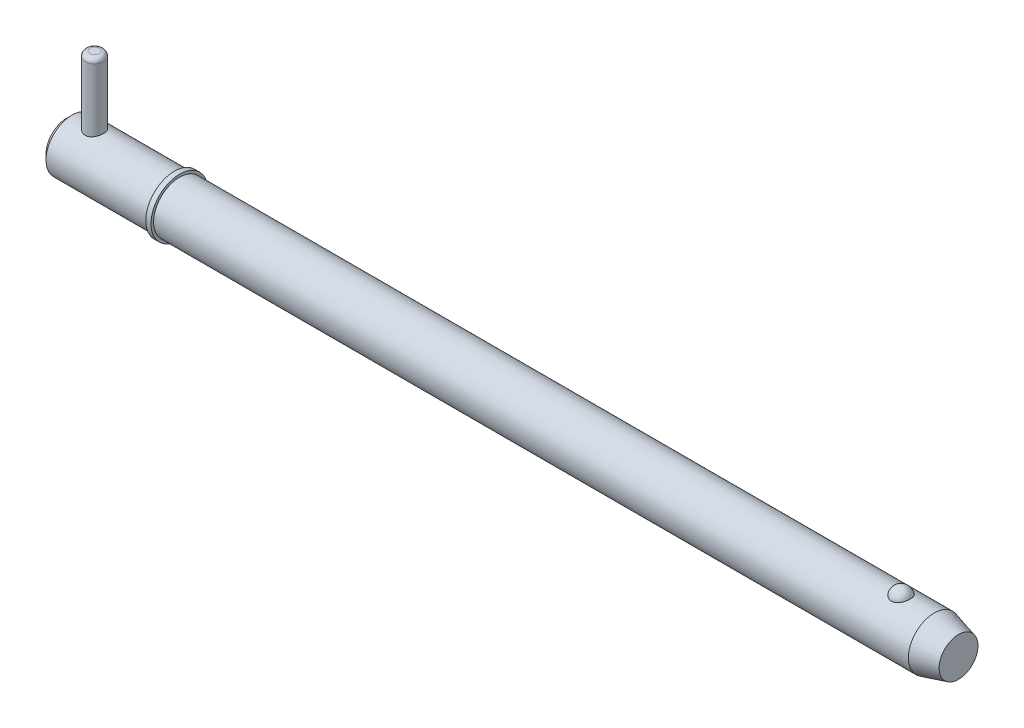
ISO-10303-21;
HEADER;
FILE_DESCRIPTION(('STEP AP214'),'2;1');
FILE_NAME('part.step','',(''),(''),'','','');
FILE_SCHEMA(('AUTOMOTIVE_DESIGN { 1 0 10303 214 1 1 1 1 }'));
ENDSEC;
DATA;
#1=APPLICATION_CONTEXT('core data for automotive mechanical design processes');
#2=APPLICATION_PROTOCOL_DEFINITION('international standard','automotive_design',2000,#1);
#3=PRODUCT_CONTEXT('',#1,'mechanical');
#4=PRODUCT('Part','Part','',(#3));
#5=PRODUCT_RELATED_PRODUCT_CATEGORY('part','',(#4));
#6=PRODUCT_DEFINITION_FORMATION('','',#4);
#7=PRODUCT_DEFINITION_CONTEXT('part definition',#1,'design');
#8=PRODUCT_DEFINITION('design','',#6,#7);
#9=PRODUCT_DEFINITION_SHAPE('','',#8);
#10=(LENGTH_UNIT() NAMED_UNIT(*) SI_UNIT(.MILLI.,.METRE.));
#11=(NAMED_UNIT(*) PLANE_ANGLE_UNIT() SI_UNIT($,.RADIAN.));
#12=(NAMED_UNIT(*) SI_UNIT($,.STERADIAN.) SOLID_ANGLE_UNIT());
#13=UNCERTAINTY_MEASURE_WITH_UNIT(LENGTH_MEASURE(1.E-05),#10,'distance_accuracy_value','');
#14=(GEOMETRIC_REPRESENTATION_CONTEXT(3) GLOBAL_UNCERTAINTY_ASSIGNED_CONTEXT((#13)) GLOBAL_UNIT_ASSIGNED_CONTEXT((#10,
#11,#12)) REPRESENTATION_CONTEXT('',''));
#15=CARTESIAN_POINT('',(0.,0.,0.));
#16=DIRECTION('',(0.,0.,1.));
#17=DIRECTION('',(1.,0.,0.));
#18=AXIS2_PLACEMENT_3D('',#15,#16,#17);
#19=CARTESIAN_POINT('',(5.94,19.845,0.));
#20=DIRECTION('',(0.,-1.,0.));
#21=DIRECTION('',(0.,0.,-1.));
#22=AXIS2_PLACEMENT_3D('',#19,#20,#21);
#23=CYLINDRICAL_SURFACE('',#22,1.98);
#24=CARTESIAN_POINT('',(5.94,-4.565,0.));
#25=DIRECTION('',(0.,1.,0.));
#26=DIRECTION('',(0.,0.,1.));
#27=AXIS2_PLACEMENT_3D('',#24,#25,#26);
#28=CIRCLE('',#27,1.98);
#29=CARTESIAN_POINT('',(5.94,-4.565,1.98));
#30=VERTEX_POINT('',#29);
#31=EDGE_CURVE('P0_E25',#30,#30,#28,.T.);
#32=ORIENTED_EDGE('',*,*,#31,.T.);
#33=EDGE_LOOP('',(#32));
#34=FACE_BOUND('',#33,.T.);
#35=CARTESIAN_POINT('',(5.94,18.855,0.));
#36=DIRECTION('',(0.,1.,0.));
#37=DIRECTION('',(0.,0.,1.));
#38=AXIS2_PLACEMENT_3D('',#35,#36,#37);
#39=CIRCLE('',#38,1.98);
#40=CARTESIAN_POINT('',(5.94,18.855,1.98));
#41=VERTEX_POINT('',#40);
#42=EDGE_CURVE('P0_E29',#41,#41,#39,.F.);
#43=ORIENTED_EDGE('',*,*,#42,.T.);
#44=EDGE_LOOP('',(#43));
#45=FACE_BOUND('',#44,.T.);
#46=ADVANCED_FACE('P0_F14',(#34,#45),#23,.T.);
#47=CARTESIAN_POINT('',(5.94,19.845,0.));
#48=DIRECTION('',(0.,1.,0.));
#49=DIRECTION('',(0.,0.,1.));
#50=AXIS2_PLACEMENT_3D('',#47,#48,#49);
#51=PLANE('',#50);
#52=CARTESIAN_POINT('',(5.94,19.845,0.));
#53=DIRECTION('',(0.,1.,0.));
#54=DIRECTION('',(0.,0.,1.));
#55=AXIS2_PLACEMENT_3D('',#52,#53,#54);
#56=CIRCLE('',#55,0.99);
#57=CARTESIAN_POINT('',(5.94,19.845,0.99));
#58=VERTEX_POINT('',#57);
#59=EDGE_CURVE('P0_E10',#58,#58,#56,.T.);
#60=ORIENTED_EDGE('',*,*,#59,.T.);
#61=EDGE_LOOP('',(#60));
#62=FACE_BOUND('',#61,.T.);
#63=ADVANCED_FACE('P0_F46',(#62),#51,.T.);
#64=CARTESIAN_POINT('',(5.94,-5.555,0.));
#65=DIRECTION('',(0.,1.,0.));
#66=DIRECTION('',(0.,0.,1.));
#67=AXIS2_PLACEMENT_3D('',#64,#65,#66);
#68=PLANE('',#67);
#69=CARTESIAN_POINT('',(5.94,-5.555,0.));
#70=DIRECTION('',(0.,1.,0.));
#71=DIRECTION('',(0.,0.,1.));
#72=AXIS2_PLACEMENT_3D('',#69,#70,#71);
#73=CIRCLE('',#72,0.99);
#74=CARTESIAN_POINT('',(5.94,-5.555,0.99));
#75=VERTEX_POINT('',#74);
#76=EDGE_CURVE('P0_E21',#75,#75,#73,.F.);
#77=ORIENTED_EDGE('',*,*,#76,.T.);
#78=EDGE_LOOP('',(#77));
#79=FACE_BOUND('',#78,.T.);
#80=ADVANCED_FACE('P0_F43',(#79),#68,.F.);
#81=CARTESIAN_POINT('',(5.94,-4.565,0.));
#82=DIRECTION('',(0.,1.,0.));
#83=DIRECTION('',(0.,0.,1.));
#84=AXIS2_PLACEMENT_3D('',#81,#82,#83);
#85=DEGENERATE_TOROIDAL_SURFACE('',#84,0.99,0.99,.T.);
#86=ORIENTED_EDGE('',*,*,#76,.F.);
#87=EDGE_LOOP('',(#86));
#88=FACE_BOUND('',#87,.T.);
#89=ORIENTED_EDGE('',*,*,#31,.F.);
#90=EDGE_LOOP('',(#89));
#91=FACE_BOUND('',#90,.T.);
#92=ADVANCED_FACE('P0_F38',(#88,#91),#85,.T.);
#93=CARTESIAN_POINT('',(5.94,18.855,0.));
#94=DIRECTION('',(0.,1.,0.));
#95=DIRECTION('',(0.,0.,1.));
#96=AXIS2_PLACEMENT_3D('',#93,#94,#95);
#97=DEGENERATE_TOROIDAL_SURFACE('',#96,0.99,0.99,.T.);
#98=ORIENTED_EDGE('',*,*,#42,.F.);
#99=EDGE_LOOP('',(#98));
#100=FACE_BOUND('',#99,.T.);
#101=ORIENTED_EDGE('',*,*,#59,.F.);
#102=EDGE_LOOP('',(#101));
#103=FACE_BOUND('',#102,.T.);
#104=ADVANCED_FACE('P0_F16',(#100,#103),#97,.T.);
#105=CLOSED_SHELL('',(#46,#63,#80,#92,#104));
#106=MANIFOLD_SOLID_BREP('P0_B1',#105);
#107=CARTESIAN_POINT('',(0.,0.,0.));
#108=DIRECTION('',(1.,0.,0.));
#109=DIRECTION('',(0.,0.,-1.));
#110=AXIS2_PLACEMENT_3D('',#107,#108,#109);
#111=CYLINDRICAL_SURFACE('',#110,5.555);
#112=CARTESIAN_POINT('',(185.617114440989,0.,0.));
#113=DIRECTION('',(1.,0.,0.));
#114=DIRECTION('',(0.,0.,-1.));
#115=AXIS2_PLACEMENT_3D('',#112,#113,#114);
#116=CIRCLE('',#115,5.555);
#117=CARTESIAN_POINT('',(185.617114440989,0.,-5.555));
#118=VERTEX_POINT('',#117);
#119=EDGE_CURVE('P1_E81',#118,#118,#116,.T.);
#120=ORIENTED_EDGE('',*,*,#119,.F.);
#121=EDGE_LOOP('',(#120));
#122=FACE_BOUND('',#121,.T.);
#123=CARTESIAN_POINT('',(24.13,0.,0.));
#124=DIRECTION('',(1.,0.,0.));
#125=DIRECTION('',(0.,0.,-1.));
#126=AXIS2_PLACEMENT_3D('',#123,#124,#125);
#127=CIRCLE('',#126,5.555);
#128=CARTESIAN_POINT('',(24.13,0.,-5.555));
#129=VERTEX_POINT('',#128);
#130=EDGE_CURVE('P1_E85',#129,#129,#127,.T.);
#131=ORIENTED_EDGE('',*,*,#130,.T.);
#132=EDGE_LOOP('',(#131));
#133=FACE_BOUND('',#132,.T.);
#134=CARTESIAN_POINT('',(178.498626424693,5.16741224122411,2.03859650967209));
#135=CARTESIAN_POINT('',(178.392949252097,5.16740893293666,2.03859990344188));
#136=CARTESIAN_POINT('',(178.28729894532,5.1707947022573,2.03008306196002));
#137=CARTESIAN_POINT('',(178.079141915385,5.18392795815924,1.99630721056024));
#138=CARTESIAN_POINT('',(177.976634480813,5.19367399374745,1.97105201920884));
#139=CARTESIAN_POINT('',(177.777771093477,5.2183916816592,1.90463997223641));
#140=CARTESIAN_POINT('',(177.681406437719,5.23335573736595,1.86350622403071));
#141=CARTESIAN_POINT('',(177.497080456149,5.26688076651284,1.76652592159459));
#142=CARTESIAN_POINT('',(177.409120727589,5.28544242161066,1.71067657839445));
#143=CARTESIAN_POINT('',(177.241265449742,5.32479845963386,1.58399959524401));
#144=CARTESIAN_POINT('',(177.16166564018,5.34564089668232,1.51279545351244));
#145=CARTESIAN_POINT('',(177.01512901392,5.38697258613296,1.35828584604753));
#146=CARTESIAN_POINT('',(176.948194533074,5.40746177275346,1.27497815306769));
#147=CARTESIAN_POINT('',(176.82561039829,5.44694508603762,1.0944029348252));
#148=CARTESIAN_POINT('',(176.770598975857,5.46583143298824,0.996677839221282));
#149=CARTESIAN_POINT('',(176.676937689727,5.49908030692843,0.792961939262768));
#150=CARTESIAN_POINT('',(176.638289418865,5.513442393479,0.686970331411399));
#151=CARTESIAN_POINT('',(176.577680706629,5.536358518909,0.468019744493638));
#152=CARTESIAN_POINT('',(176.555972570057,5.54482455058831,0.354981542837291));
#153=CARTESIAN_POINT('',(176.530636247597,5.55473324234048,0.126595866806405));
#154=CARTESIAN_POINT('',(176.527007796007,5.55617600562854,0.0112484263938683));
#155=CARTESIAN_POINT('',(176.537881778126,5.55189984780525,-0.218011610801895));
#156=CARTESIAN_POINT('',(176.552315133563,5.54620821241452,-0.331928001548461));
#157=CARTESIAN_POINT('',(176.598903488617,5.52828920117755,-0.55554427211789));
#158=CARTESIAN_POINT('',(176.631058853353,5.51606169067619,-0.665244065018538));
#159=CARTESIAN_POINT('',(176.712488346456,5.48630779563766,-0.877469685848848));
#160=CARTESIAN_POINT('',(176.761781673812,5.46877547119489,-0.9799873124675));
#161=CARTESIAN_POINT('',(176.876478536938,5.43024700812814,-1.17486975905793));
#162=CARTESIAN_POINT('',(176.941883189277,5.40925062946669,-1.26723387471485));
#163=CARTESIAN_POINT('',(177.087571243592,5.36600927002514,-1.43940133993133));
#164=CARTESIAN_POINT('',(177.167885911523,5.34376173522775,-1.51917763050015));
#165=CARTESIAN_POINT('',(177.341452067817,5.30057971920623,-1.66360338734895));
#166=CARTESIAN_POINT('',(177.434702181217,5.27964509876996,-1.72825445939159));
#167=CARTESIAN_POINT('',(177.629393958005,5.24205250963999,-1.83909478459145));
#168=CARTESIAN_POINT('',(177.730590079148,5.22530519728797,-1.885684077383));
#169=CARTESIAN_POINT('',(177.940155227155,5.19750919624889,-1.96100802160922));
#170=CARTESIAN_POINT('',(178.048521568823,5.18645838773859,-1.9897493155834));
#171=CARTESIAN_POINT('',(178.263498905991,5.17184410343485,-2.02742262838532));
#172=CARTESIAN_POINT('',(178.369925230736,5.16793282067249,-2.03727608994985));
#173=CARTESIAN_POINT('',(178.582992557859,5.16698995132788,-2.03966777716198));
#174=CARTESIAN_POINT('',(178.689633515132,5.16995704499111,-2.03220932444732));
#175=CARTESIAN_POINT('',(178.896773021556,5.18222383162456,-2.00071170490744));
#176=CARTESIAN_POINT('',(178.997359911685,5.19133213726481,-1.97717337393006));
#177=CARTESIAN_POINT('',(179.193014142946,5.21467637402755,-1.91475248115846));
#178=CARTESIAN_POINT('',(179.288081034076,5.22891272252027,-1.87586867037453));
#179=CARTESIAN_POINT('',(179.472371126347,5.26137066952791,-1.78282713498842));
#180=CARTESIAN_POINT('',(179.561419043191,5.27967329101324,-1.72835124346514));
#181=CARTESIAN_POINT('',(179.729288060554,5.3181741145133,-1.60597483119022));
#182=CARTESIAN_POINT('',(179.808106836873,5.33837274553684,-1.5380712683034));
#183=CARTESIAN_POINT('',(179.957515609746,5.37968287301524,-1.38688970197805));
#184=CARTESIAN_POINT('',(180.027505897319,5.40079011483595,-1.30301744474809));
#185=CARTESIAN_POINT('',(180.153012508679,5.44074401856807,-1.12458170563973));
#186=CARTESIAN_POINT('',(180.208526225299,5.4595902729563,-1.03001630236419));
#187=CARTESIAN_POINT('',(180.305550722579,5.49369849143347,-0.829439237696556));
#188=CARTESIAN_POINT('',(180.34654838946,5.50882422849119,-0.723155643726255));
#189=CARTESIAN_POINT('',(180.411125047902,5.53310911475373,-0.504772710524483));
#190=CARTESIAN_POINT('',(180.434703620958,5.54226812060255,-0.392673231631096));
#191=CARTESIAN_POINT('',(180.464013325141,5.55370358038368,-0.165459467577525));
#192=CARTESIAN_POINT('',(180.469688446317,5.55595843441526,-0.0503368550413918));
#193=CARTESIAN_POINT('',(180.462916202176,5.55329317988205,0.179288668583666));
#194=CARTESIAN_POINT('',(180.450469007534,5.54837313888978,0.293791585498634));
#195=CARTESIAN_POINT('',(180.407779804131,5.53189037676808,0.518526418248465));
#196=CARTESIAN_POINT('',(180.377598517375,5.5203503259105,0.628771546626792));
#197=CARTESIAN_POINT('',(180.300096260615,5.49182453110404,0.842318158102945));
#198=CARTESIAN_POINT('',(180.252774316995,5.47483847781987,0.945619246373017));
#199=CARTESIAN_POINT('',(180.141720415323,5.43710633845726,1.14281571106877));
#200=CARTESIAN_POINT('',(180.077921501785,5.41634501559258,1.23667048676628));
#201=CARTESIAN_POINT('',(179.935357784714,5.37334572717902,1.41185243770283));
#202=CARTESIAN_POINT('',(179.85659323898,5.35110778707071,1.49317982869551));
#203=CARTESIAN_POINT('',(179.686423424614,5.30779474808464,1.64049162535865));
#204=CARTESIAN_POINT('',(179.59510026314,5.28671324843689,1.70656877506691));
#205=CARTESIAN_POINT('',(179.401739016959,5.24804852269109,1.82201372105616));
#206=CARTESIAN_POINT('',(179.299700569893,5.23046541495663,1.87138095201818));
#207=CARTESIAN_POINT('',(179.083618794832,5.20042692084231,1.95335298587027));
#208=CARTESIAN_POINT('',(178.969260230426,5.18820192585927,1.98521734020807));
#209=CARTESIAN_POINT('',(178.736130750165,5.17169804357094,2.02783294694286));
#210=CARTESIAN_POINT('',(178.617361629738,5.16741595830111,2.03859269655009));
#211=CARTESIAN_POINT('',(178.498626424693,5.16741224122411,2.03859650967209));
#212=B_SPLINE_CURVE_WITH_KNOTS('',3,(#134,#135,#136,#137,#138,#139,#140,#141,#142,#143,#144,
#145,#146,#147,#148,#149,#150,#151,#152,#153,#154,#155,#156,#157,#158,#159,#160,#161,#162,#163,
#164,#165,#166,#167,#168,#169,#170,#171,#172,#173,#174,#175,#176,#177,#178,#179,#180,#181,#182,
#183,#184,#185,#186,#187,#188,#189,#190,#191,#192,#193,#194,#195,#196,#197,#198,#199,#200,#201,
#202,#203,#204,#205,#206,#207,#208,#209,#210,#211),.UNSPECIFIED.,.T.,.F.,(4,2,2,2,2,2,2,2,2,2,2,
2,2,2,2,2,2,2,2,2,2,2,2,2,2,2,2,2,2,2,2,2,2,2,2,2,2,2,4),(0.,0.316595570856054,
0.633118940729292,0.949183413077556,1.26530783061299,1.59030762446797,1.91536729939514,
2.2549582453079,2.59458224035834,2.93917283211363,3.2837583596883,3.62703002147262,
3.97030875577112,4.3139732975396,4.6576616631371,5.00207904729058,5.34645984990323,
5.68270547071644,6.01882587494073,6.33808403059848,6.65728093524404,6.96696376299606,
7.27667180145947,7.5932153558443,7.90983070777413,8.24210387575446,8.57443684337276,
8.91755896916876,9.26068933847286,9.60489211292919,9.94909164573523,10.292119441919,
10.6351667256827,10.9796305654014,11.3240884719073,11.6663928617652,12.0087088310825,
12.3645679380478,12.7202837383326),.UNSPECIFIED.);
#213=CARTESIAN_POINT('',(178.498626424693,5.16741224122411,2.03859650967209));
#214=VERTEX_POINT('',#213);
#215=EDGE_CURVE('P1_E35',#214,#214,#212,.T.);
#216=ORIENTED_EDGE('',*,*,#215,.T.);
#217=EDGE_LOOP('',(#216));
#218=FACE_BOUND('',#217,.T.);
#219=ADVANCED_FACE('P1_F13',(#122,#133,#218),#111,.T.);
#220=CARTESIAN_POINT('',(0.,0.,0.));
#221=DIRECTION('',(-1.,0.,0.));
#222=DIRECTION('',(0.,0.,1.));
#223=AXIS2_PLACEMENT_3D('',#220,#221,#222);
#224=PLANE('',#223);
#225=CARTESIAN_POINT('',(0.,0.,0.));
#226=DIRECTION('',(1.,0.,0.));
#227=DIRECTION('',(0.,0.,-1.));
#228=AXIS2_PLACEMENT_3D('',#225,#226,#227);
#229=CIRCLE('',#228,4.444);
#230=CARTESIAN_POINT('',(0.,0.,-4.444));
#231=VERTEX_POINT('',#230);
#232=EDGE_CURVE('P1_E9',#231,#231,#229,.T.);
#233=ORIENTED_EDGE('',*,*,#232,.F.);
#234=EDGE_LOOP('',(#233));
#235=FACE_BOUND('',#234,.T.);
#236=ADVANCED_FACE('P1_F15',(#235),#224,.T.);
#237=CARTESIAN_POINT('',(1.111,0.,0.));
#238=DIRECTION('',(1.,0.,0.));
#239=DIRECTION('',(0.,0.,-1.));
#240=AXIS2_PLACEMENT_3D('',#237,#238,#239);
#241=CONICAL_SURFACE('',#240,5.555,0.78539816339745);
#242=ORIENTED_EDGE('',*,*,#232,.T.);
#243=EDGE_LOOP('',(#242));
#244=FACE_BOUND('',#243,.T.);
#245=CARTESIAN_POINT('',(1.111,0.,0.));
#246=DIRECTION('',(1.,0.,0.));
#247=DIRECTION('',(0.,0.,-1.));
#248=AXIS2_PLACEMENT_3D('',#245,#246,#247);
#249=CIRCLE('',#248,5.555);
#250=CARTESIAN_POINT('',(1.111,0.,-5.555));
#251=VERTEX_POINT('',#250);
#252=EDGE_CURVE('P1_E26',#251,#251,#249,.T.);
#253=ORIENTED_EDGE('',*,*,#252,.F.);
#254=EDGE_LOOP('',(#253));
#255=FACE_BOUND('',#254,.T.);
#256=ADVANCED_FACE('P1_F77',(#244,#255),#241,.T.);
#257=CARTESIAN_POINT('',(0.,0.,0.));
#258=DIRECTION('',(1.,0.,0.));
#259=DIRECTION('',(0.,0.,-1.));
#260=AXIS2_PLACEMENT_3D('',#257,#258,#259);
#261=CYLINDRICAL_SURFACE('',#260,5.555);
#262=CARTESIAN_POINT('',(5.94,-5.19014691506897,1.98));
#263=CARTESIAN_POINT('',(5.83264687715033,-5.19014494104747,1.98000226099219));
#264=CARTESIAN_POINT('',(5.7253094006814,-5.19351395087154,1.97123988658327));
#265=CARTESIAN_POINT('',(5.51384517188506,-5.20654291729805,1.93656219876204));
#266=CARTESIAN_POINT('',(5.40971858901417,-5.21620320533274,1.91064598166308));
#267=CARTESIAN_POINT('',(5.20778082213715,-5.24058443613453,1.84271148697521));
#268=CARTESIAN_POINT('',(5.10995634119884,-5.25529427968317,1.80072850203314));
#269=CARTESIAN_POINT('',(4.92270352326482,-5.28810012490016,1.70197537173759));
#270=CARTESIAN_POINT('',(4.83327743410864,-5.3061970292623,1.64520128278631));
#271=CARTESIAN_POINT('',(4.66135184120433,-5.34464714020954,1.51575187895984));
#272=CARTESIAN_POINT('',(4.57928277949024,-5.36506222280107,1.44252311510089));
#273=CARTESIAN_POINT('',(4.42829115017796,-5.40532920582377,1.28342047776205));
#274=CARTESIAN_POINT('',(4.35937105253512,-5.42518099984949,1.19754423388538));
#275=CARTESIAN_POINT('',(4.23461605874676,-5.46281133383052,1.01237205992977));
#276=CARTESIAN_POINT('',(4.17924129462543,-5.48050875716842,0.912748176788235));
#277=CARTESIAN_POINT('',(4.0862117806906,-5.51109938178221,0.70485824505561));
#278=CARTESIAN_POINT('',(4.0485515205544,-5.52399407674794,0.596594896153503));
#279=CARTESIAN_POINT('',(3.99350662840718,-5.54308759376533,0.379019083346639));
#280=CARTESIAN_POINT('',(3.97538263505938,-5.54952987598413,0.269915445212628));
#281=CARTESIAN_POINT('',(3.95756405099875,-5.55586205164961,0.0500378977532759));
#282=CARTESIAN_POINT('',(3.95786404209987,-5.55575387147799,-0.060735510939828));
#283=CARTESIAN_POINT('',(3.97643665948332,-5.54915684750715,-0.275539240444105));
#284=CARTESIAN_POINT('',(3.99390415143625,-5.54295384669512,-0.379649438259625));
#285=CARTESIAN_POINT('',(4.0449721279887,-5.52523170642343,-0.583350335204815));
#286=CARTESIAN_POINT('',(4.07857373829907,-5.51371219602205,-0.682940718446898));
#287=CARTESIAN_POINT('',(4.16137312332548,-5.4863099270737,-0.876423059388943));
#288=CARTESIAN_POINT('',(4.2107826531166,-5.47036834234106,-0.970215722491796));
#289=CARTESIAN_POINT('',(4.32361427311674,-5.43575653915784,-1.1484017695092));
#290=CARTESIAN_POINT('',(4.38704062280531,-5.41708549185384,-1.23279228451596));
#291=CARTESIAN_POINT('',(4.53006791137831,-5.37778429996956,-1.39454579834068));
#292=CARTESIAN_POINT('',(4.61035105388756,-5.35710277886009,-1.4712940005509));
#293=CARTESIAN_POINT('',(4.78279835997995,-5.31692766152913,-1.6104545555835));
#294=CARTESIAN_POINT('',(4.874964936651,-5.29743430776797,-1.67286398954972));
#295=CARTESIAN_POINT('',(5.07076688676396,-5.26153775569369,-1.78259698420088));
#296=CARTESIAN_POINT('',(5.17458163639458,-5.24519780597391,-1.8296227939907));
#297=CARTESIAN_POINT('',(5.38938990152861,-5.21818744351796,-1.90530278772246));
#298=CARTESIAN_POINT('',(5.50037985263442,-5.20751423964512,-1.93396601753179));
#299=CARTESIAN_POINT('',(5.72036376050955,-5.19369176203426,-1.97077654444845));
#300=CARTESIAN_POINT('',(5.82917370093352,-5.19018851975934,-1.97989015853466));
#301=CARTESIAN_POINT('',(6.04680100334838,-5.19010609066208,-1.98010779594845));
#302=CARTESIAN_POINT('',(6.15561835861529,-5.19352540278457,-1.97121572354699));
#303=CARTESIAN_POINT('',(6.36548036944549,-5.20654623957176,-1.93654727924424));
#304=CARTESIAN_POINT('',(6.46666051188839,-5.21588705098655,-1.91148218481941));
#305=CARTESIAN_POINT('',(6.66334537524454,-5.23939939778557,-1.84605494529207));
#306=CARTESIAN_POINT('',(6.75884899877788,-5.25357186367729,-1.8056898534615));
#307=CARTESIAN_POINT('',(6.94517989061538,-5.28576258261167,-1.70921153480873));
#308=CARTESIAN_POINT('',(7.03572661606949,-5.30389804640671,-1.65259670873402));
#309=CARTESIAN_POINT('',(7.20638087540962,-5.34176077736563,-1.52577523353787));
#310=CARTESIAN_POINT('',(7.28648490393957,-5.36148857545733,-1.45556404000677));
#311=CARTESIAN_POINT('',(7.43864697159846,-5.40165494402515,-1.2988614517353));
#312=CARTESIAN_POINT('',(7.50999887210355,-5.42207106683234,-1.21167640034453));
#313=CARTESIAN_POINT('',(7.63712639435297,-5.46023601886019,-1.026066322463));
#314=CARTESIAN_POINT('',(7.69290228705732,-5.47798489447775,-0.927641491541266));
#315=CARTESIAN_POINT('',(7.78684673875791,-5.50876590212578,-0.722633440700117));
#316=CARTESIAN_POINT('',(7.82510508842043,-5.52182201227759,-0.616095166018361));
#317=CARTESIAN_POINT('',(7.88297051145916,-5.54184206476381,-0.397530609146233));
#318=CARTESIAN_POINT('',(7.90258540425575,-5.5488085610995,-0.285506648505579));
#319=CARTESIAN_POINT('',(7.9218262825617,-5.55564472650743,-0.065566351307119));
#320=CARTESIAN_POINT('',(7.92245987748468,-5.55587212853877,0.0422515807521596));
#321=CARTESIAN_POINT('',(7.90626329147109,-5.55011340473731,0.256387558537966));
#322=CARTESIAN_POINT('',(7.88943488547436,-5.54412791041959,0.362705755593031));
#323=CARTESIAN_POINT('',(7.83948457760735,-5.52676548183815,0.568649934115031));
#324=CARTESIAN_POINT('',(7.8067003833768,-5.51550046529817,0.668367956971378));
#325=CARTESIAN_POINT('',(7.72609369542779,-5.48874437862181,0.860911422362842));
#326=CARTESIAN_POINT('',(7.67826838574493,-5.47325251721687,0.953735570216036));
#327=CARTESIAN_POINT('',(7.56675024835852,-5.43884382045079,1.13391068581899));
#328=CARTESIAN_POINT('',(7.50249968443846,-5.41981485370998,1.22089468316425));
#329=CARTESIAN_POINT('',(7.36086495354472,-5.38069275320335,1.38316665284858));
#330=CARTESIAN_POINT('',(7.28347630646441,-5.36059925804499,1.45845061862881));
#331=CARTESIAN_POINT('',(7.11347587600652,-5.32048380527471,1.59876646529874));
#332=CARTESIAN_POINT('',(7.02032386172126,-5.30050854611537,1.66315951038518));
#333=CARTESIAN_POINT('',(6.82388804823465,-5.26398994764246,1.77536801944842));
#334=CARTESIAN_POINT('',(6.7206049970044,-5.24744635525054,1.82318470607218));
#335=CARTESIAN_POINT('',(6.50639706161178,-5.21987969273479,1.90068230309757));
#336=CARTESIAN_POINT('',(6.3954529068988,-5.20887116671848,1.93031547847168));
#337=CARTESIAN_POINT('',(6.16966522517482,-5.19400760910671,1.96996824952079));
#338=CARTESIAN_POINT('',(6.05482366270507,-5.19014902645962,1.97999758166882));
#339=CARTESIAN_POINT('',(5.94,-5.19014691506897,1.98));
#340=B_SPLINE_CURVE_WITH_KNOTS('',3,(#262,#263,#264,#265,#266,#267,#268,#269,#270,#271,#272,
#273,#274,#275,#276,#277,#278,#279,#280,#281,#282,#283,#284,#285,#286,#287,#288,#289,#290,#291,
#292,#293,#294,#295,#296,#297,#298,#299,#300,#301,#302,#303,#304,#305,#306,#307,#308,#309,#310,
#311,#312,#313,#314,#315,#316,#317,#318,#319,#320,#321,#322,#323,#324,#325,#326,#327,#328,#329,
#330,#331,#332,#333,#334,#335,#336,#337,#338,#339),.UNSPECIFIED.,.T.,.F.,(4,2,2,2,2,2,2,2,2,2,2,
2,2,2,2,2,2,2,2,2,2,2,2,2,2,2,2,2,2,2,2,2,2,2,2,2,2,2,4),(0.,0.321632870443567,
0.643282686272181,0.964229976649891,1.28526292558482,1.61937087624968,1.9535415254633,
2.29784481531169,2.64204093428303,2.97269632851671,3.30325448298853,3.61901541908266,
3.93479838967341,4.25500220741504,4.57530346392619,4.91268648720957,5.25013812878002,
5.59378026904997,5.93725299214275,6.26331481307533,6.58930593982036,6.90185604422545,
7.21446637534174,7.53801472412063,7.86167140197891,8.20353561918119,8.54539388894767,
8.88547970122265,9.22542281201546,9.54728637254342,9.86911722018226,10.1844146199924,
10.4997710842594,10.827730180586,11.1558013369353,11.499115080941,11.8424034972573,
12.1865892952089,12.5306041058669),.UNSPECIFIED.);
#341=CARTESIAN_POINT('',(5.94,-5.19014691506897,1.98));
#342=VERTEX_POINT('',#341);
#343=EDGE_CURVE('P1_E17',#342,#342,#340,.T.);
#344=ORIENTED_EDGE('',*,*,#343,.F.);
#345=EDGE_LOOP('',(#344));
#346=FACE_BOUND('',#345,.T.);
#347=CARTESIAN_POINT('',(5.94,5.19014691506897,1.98));
#348=CARTESIAN_POINT('',(6.04735312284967,5.19014494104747,1.98000226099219));
#349=CARTESIAN_POINT('',(6.1546905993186,5.19351395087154,1.97123988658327));
#350=CARTESIAN_POINT('',(6.36615482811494,5.20654291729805,1.93656219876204));
#351=CARTESIAN_POINT('',(6.47028141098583,5.21620320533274,1.91064598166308));
#352=CARTESIAN_POINT('',(6.67221917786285,5.24058443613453,1.84271148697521));
#353=CARTESIAN_POINT('',(6.77004365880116,5.25529427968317,1.80072850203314));
#354=CARTESIAN_POINT('',(6.95729647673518,5.28810012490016,1.70197537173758));
#355=CARTESIAN_POINT('',(7.04672256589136,5.3061970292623,1.64520128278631));
#356=CARTESIAN_POINT('',(7.21864815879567,5.34464714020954,1.51575187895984));
#357=CARTESIAN_POINT('',(7.30071722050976,5.36506222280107,1.44252311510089));
#358=CARTESIAN_POINT('',(7.45170884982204,5.40532920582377,1.28342047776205));
#359=CARTESIAN_POINT('',(7.52062894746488,5.42518099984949,1.19754423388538));
#360=CARTESIAN_POINT('',(7.64538394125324,5.46281133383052,1.01237205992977));
#361=CARTESIAN_POINT('',(7.70075870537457,5.48050875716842,0.912748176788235));
#362=CARTESIAN_POINT('',(7.7937882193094,5.51109938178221,0.704858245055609));
#363=CARTESIAN_POINT('',(7.8314484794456,5.52399407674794,0.596594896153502));
#364=CARTESIAN_POINT('',(7.88649337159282,5.54308759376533,0.379019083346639));
#365=CARTESIAN_POINT('',(7.90461736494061,5.54952987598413,0.269915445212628));
#366=CARTESIAN_POINT('',(7.92243594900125,5.55586205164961,0.0500378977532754));
#367=CARTESIAN_POINT('',(7.92213595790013,5.55575387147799,-0.0607355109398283));
#368=CARTESIAN_POINT('',(7.90356334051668,5.54915684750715,-0.275539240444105));
#369=CARTESIAN_POINT('',(7.88609584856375,5.54295384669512,-0.379649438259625));
#370=CARTESIAN_POINT('',(7.8350278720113,5.52523170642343,-0.583350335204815));
#371=CARTESIAN_POINT('',(7.80142626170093,5.51371219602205,-0.682940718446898));
#372=CARTESIAN_POINT('',(7.71862687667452,5.4863099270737,-0.876423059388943));
#373=CARTESIAN_POINT('',(7.6692173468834,5.47036834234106,-0.970215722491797));
#374=CARTESIAN_POINT('',(7.55638572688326,5.43575653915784,-1.1484017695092));
#375=CARTESIAN_POINT('',(7.49295937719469,5.41708549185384,-1.23279228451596));
#376=CARTESIAN_POINT('',(7.34993208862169,5.37778429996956,-1.39454579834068));
#377=CARTESIAN_POINT('',(7.26964894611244,5.35710277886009,-1.4712940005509));
#378=CARTESIAN_POINT('',(7.09720164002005,5.31692766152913,-1.6104545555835));
#379=CARTESIAN_POINT('',(7.00503506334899,5.29743430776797,-1.67286398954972));
#380=CARTESIAN_POINT('',(6.80923311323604,5.26153775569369,-1.78259698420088));
#381=CARTESIAN_POINT('',(6.70541836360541,5.24519780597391,-1.8296227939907));
#382=CARTESIAN_POINT('',(6.49061009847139,5.21818744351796,-1.90530278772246));
#383=CARTESIAN_POINT('',(6.37962014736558,5.20751423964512,-1.93396601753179));
#384=CARTESIAN_POINT('',(6.15963623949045,5.19369176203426,-1.97077654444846));
#385=CARTESIAN_POINT('',(6.05082629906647,5.19018851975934,-1.97989015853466));
#386=CARTESIAN_POINT('',(5.83319899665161,5.19010609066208,-1.98010779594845));
#387=CARTESIAN_POINT('',(5.7243816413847,5.19352540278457,-1.97121572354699));
#388=CARTESIAN_POINT('',(5.5145196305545,5.20654623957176,-1.93654727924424));
#389=CARTESIAN_POINT('',(5.4133394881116,5.21588705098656,-1.91148218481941));
#390=CARTESIAN_POINT('',(5.21665462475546,5.23939939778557,-1.84605494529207));
#391=CARTESIAN_POINT('',(5.12115100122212,5.25357186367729,-1.8056898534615));
#392=CARTESIAN_POINT('',(4.93482010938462,5.28576258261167,-1.70921153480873));
#393=CARTESIAN_POINT('',(4.84427338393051,5.30389804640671,-1.65259670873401));
#394=CARTESIAN_POINT('',(4.67361912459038,5.34176077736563,-1.52577523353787));
#395=CARTESIAN_POINT('',(4.59351509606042,5.36148857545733,-1.45556404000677));
#396=CARTESIAN_POINT('',(4.44135302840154,5.40165494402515,-1.2988614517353));
#397=CARTESIAN_POINT('',(4.37000112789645,5.42207106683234,-1.21167640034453));
#398=CARTESIAN_POINT('',(4.24287360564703,5.46023601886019,-1.026066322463));
#399=CARTESIAN_POINT('',(4.18709771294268,5.47798489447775,-0.927641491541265));
#400=CARTESIAN_POINT('',(4.09315326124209,5.50876590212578,-0.722633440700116));
#401=CARTESIAN_POINT('',(4.05489491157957,5.52182201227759,-0.61609516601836));
#402=CARTESIAN_POINT('',(3.99702948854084,5.54184206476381,-0.397530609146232));
#403=CARTESIAN_POINT('',(3.97741459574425,5.5488085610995,-0.285506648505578));
#404=CARTESIAN_POINT('',(3.9581737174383,5.55564472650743,-0.0655663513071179));
#405=CARTESIAN_POINT('',(3.95754012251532,5.55587212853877,0.0422515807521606));
#406=CARTESIAN_POINT('',(3.97373670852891,5.55011340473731,0.256387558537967));
#407=CARTESIAN_POINT('',(3.99056511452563,5.54412791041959,0.362705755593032));
#408=CARTESIAN_POINT('',(4.04051542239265,5.52676548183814,0.568649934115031));
#409=CARTESIAN_POINT('',(4.07329961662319,5.51550046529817,0.668367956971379));
#410=CARTESIAN_POINT('',(4.15390630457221,5.48874437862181,0.860911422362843));
#411=CARTESIAN_POINT('',(4.20173161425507,5.47325251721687,0.953735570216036));
#412=CARTESIAN_POINT('',(4.31324975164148,5.43884382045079,1.13391068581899));
#413=CARTESIAN_POINT('',(4.37750031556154,5.41981485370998,1.22089468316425));
#414=CARTESIAN_POINT('',(4.51913504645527,5.38069275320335,1.38316665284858));
#415=CARTESIAN_POINT('',(4.59652369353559,5.36059925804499,1.45845061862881));
#416=CARTESIAN_POINT('',(4.76652412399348,5.32048380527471,1.59876646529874));
#417=CARTESIAN_POINT('',(4.85967613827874,5.30050854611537,1.66315951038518));
#418=CARTESIAN_POINT('',(5.05611195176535,5.26398994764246,1.77536801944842));
#419=CARTESIAN_POINT('',(5.1593950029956,5.24744635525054,1.82318470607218));
#420=CARTESIAN_POINT('',(5.37360293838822,5.21987969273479,1.90068230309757));
#421=CARTESIAN_POINT('',(5.4845470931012,5.20887116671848,1.93031547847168));
#422=CARTESIAN_POINT('',(5.71033477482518,5.19400760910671,1.96996824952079));
#423=CARTESIAN_POINT('',(5.82517633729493,5.19014902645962,1.97999758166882));
#424=CARTESIAN_POINT('',(5.94,5.19014691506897,1.98));
#425=B_SPLINE_CURVE_WITH_KNOTS('',3,(#347,#348,#349,#350,#351,#352,#353,#354,#355,#356,#357,
#358,#359,#360,#361,#362,#363,#364,#365,#366,#367,#368,#369,#370,#371,#372,#373,#374,#375,#376,
#377,#378,#379,#380,#381,#382,#383,#384,#385,#386,#387,#388,#389,#390,#391,#392,#393,#394,#395,
#396,#397,#398,#399,#400,#401,#402,#403,#404,#405,#406,#407,#408,#409,#410,#411,#412,#413,#414,
#415,#416,#417,#418,#419,#420,#421,#422,#423,#424),.UNSPECIFIED.,.T.,.F.,(4,2,2,2,2,2,2,2,2,2,2,
2,2,2,2,2,2,2,2,2,2,2,2,2,2,2,2,2,2,2,2,2,2,2,2,2,2,2,4),(0.,0.321632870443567,
0.643282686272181,0.964229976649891,1.28526292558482,1.61937087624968,1.9535415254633,
2.29784481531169,2.64204093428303,2.97269632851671,3.30325448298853,3.61901541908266,
3.93479838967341,4.25500220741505,4.57530346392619,4.91268648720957,5.25013812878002,
5.59378026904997,5.93725299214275,6.26331481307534,6.58930593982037,6.90185604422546,
7.21446637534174,7.53801472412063,7.86167140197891,8.20353561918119,8.54539388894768,
8.88547970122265,9.22542281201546,9.54728637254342,9.86911722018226,10.1844146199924,
10.4997710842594,10.827730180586,11.1558013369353,11.499115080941,11.8424034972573,
12.1865892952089,12.5306041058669),.UNSPECIFIED.);
#426=CARTESIAN_POINT('',(5.94,5.19014691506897,1.98));
#427=VERTEX_POINT('',#426);
#428=EDGE_CURVE('P1_E43',#427,#427,#425,.T.);
#429=ORIENTED_EDGE('',*,*,#428,.F.);
#430=EDGE_LOOP('',(#429));
#431=FACE_BOUND('',#430,.T.);
#432=ORIENTED_EDGE('',*,*,#252,.T.);
#433=EDGE_LOOP('',(#432));
#434=FACE_BOUND('',#433,.T.);
#435=CARTESIAN_POINT('',(23.019,0.,0.));
#436=DIRECTION('',(1.,0.,0.));
#437=DIRECTION('',(0.,0.,-1.));
#438=AXIS2_PLACEMENT_3D('',#435,#436,#437);
#439=CIRCLE('',#438,5.555);
#440=CARTESIAN_POINT('',(23.019,0.,-5.555));
#441=VERTEX_POINT('',#440);
#442=EDGE_CURVE('P1_E31',#441,#441,#439,.T.);
#443=ORIENTED_EDGE('',*,*,#442,.F.);
#444=EDGE_LOOP('',(#443));
#445=FACE_BOUND('',#444,.T.);
#446=ADVANCED_FACE('P1_F103',(#346,#431,#434,#445),#261,.T.);
#447=CARTESIAN_POINT('',(23.019,5.555,0.));
#448=DIRECTION('',(-1.,0.,0.));
#449=DIRECTION('',(0.,0.,1.));
#450=AXIS2_PLACEMENT_3D('',#447,#448,#449);
#451=PLANE('',#450);
#452=ORIENTED_EDGE('',*,*,#442,.T.);
#453=EDGE_LOOP('',(#452));
#454=FACE_BOUND('',#453,.T.);
#455=CARTESIAN_POINT('',(23.019,0.,0.));
#456=DIRECTION('',(1.,0.,0.));
#457=DIRECTION('',(0.,0.,-1.));
#458=AXIS2_PLACEMENT_3D('',#455,#456,#457);
#459=CIRCLE('',#458,6.1105);
#460=CARTESIAN_POINT('',(23.019,0.,-6.1105));
#461=VERTEX_POINT('',#460);
#462=EDGE_CURVE('P1_E91',#461,#461,#459,.T.);
#463=ORIENTED_EDGE('',*,*,#462,.F.);
#464=EDGE_LOOP('',(#463));
#465=FACE_BOUND('',#464,.T.);
#466=ADVANCED_FACE('P1_F100',(#454,#465),#451,.T.);
#467=CARTESIAN_POINT('',(0.,0.,0.));
#468=DIRECTION('',(1.,0.,0.));
#469=DIRECTION('',(0.,0.,-1.));
#470=AXIS2_PLACEMENT_3D('',#467,#468,#469);
#471=CYLINDRICAL_SURFACE('',#470,6.1105);
#472=ORIENTED_EDGE('',*,*,#462,.T.);
#473=EDGE_LOOP('',(#472));
#474=FACE_BOUND('',#473,.T.);
#475=CARTESIAN_POINT('',(24.13,0.,0.));
#476=DIRECTION('',(1.,0.,0.));
#477=DIRECTION('',(0.,0.,-1.));
#478=AXIS2_PLACEMENT_3D('',#475,#476,#477);
#479=CIRCLE('',#478,6.1105);
#480=CARTESIAN_POINT('',(24.13,0.,-6.1105));
#481=VERTEX_POINT('',#480);
#482=EDGE_CURVE('P1_E88',#481,#481,#479,.T.);
#483=ORIENTED_EDGE('',*,*,#482,.F.);
#484=EDGE_LOOP('',(#483));
#485=FACE_BOUND('',#484,.T.);
#486=ADVANCED_FACE('P1_F68',(#474,#485),#471,.T.);
#487=CARTESIAN_POINT('',(24.13,6.1105,0.));
#488=DIRECTION('',(1.,0.,0.));
#489=DIRECTION('',(0.,0.,-1.));
#490=AXIS2_PLACEMENT_3D('',#487,#488,#489);
#491=PLANE('',#490);
#492=ORIENTED_EDGE('',*,*,#482,.T.);
#493=EDGE_LOOP('',(#492));
#494=FACE_BOUND('',#493,.T.);
#495=ORIENTED_EDGE('',*,*,#130,.F.);
#496=EDGE_LOOP('',(#495));
#497=FACE_BOUND('',#496,.T.);
#498=ADVANCED_FACE('P1_F62',(#494,#497),#491,.T.);
#499=CARTESIAN_POINT('',(190.8,0.,0.));
#500=DIRECTION('',(-1.,0.,0.));
#501=DIRECTION('',(0.,0.,1.));
#502=AXIS2_PLACEMENT_3D('',#499,#500,#501);
#503=CONICAL_SURFACE('',#502,4.16625000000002,0.261799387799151);
#504=ORIENTED_EDGE('',*,*,#119,.T.);
#505=EDGE_LOOP('',(#504));
#506=FACE_BOUND('',#505,.T.);
#507=CARTESIAN_POINT('',(190.8,0.,0.));
#508=DIRECTION('',(1.,0.,0.));
#509=DIRECTION('',(0.,0.,-1.));
#510=AXIS2_PLACEMENT_3D('',#507,#508,#509);
#511=CIRCLE('',#510,4.16625000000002);
#512=CARTESIAN_POINT('',(190.8,0.,-4.16625000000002));
#513=VERTEX_POINT('',#512);
#514=EDGE_CURVE('P1_E42',#513,#513,#511,.T.);
#515=ORIENTED_EDGE('',*,*,#514,.F.);
#516=EDGE_LOOP('',(#515));
#517=FACE_BOUND('',#516,.T.);
#518=ADVANCED_FACE('P1_F59',(#506,#517),#503,.T.);
#519=CARTESIAN_POINT('',(190.8,4.16625000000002,0.));
#520=DIRECTION('',(1.,0.,0.));
#521=DIRECTION('',(0.,0.,-1.));
#522=AXIS2_PLACEMENT_3D('',#519,#520,#521);
#523=PLANE('',#522);
#524=ORIENTED_EDGE('',*,*,#514,.T.);
#525=EDGE_LOOP('',(#524));
#526=FACE_BOUND('',#525,.T.);
#527=ADVANCED_FACE('P1_F55',(#526),#523,.T.);
#528=CARTESIAN_POINT('',(178.498626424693,4.9995,0.));
#529=DIRECTION('',(-1.,0.,0.));
#530=DIRECTION('',(0.,1.,0.));
#531=AXIS2_PLACEMENT_3D('',#528,#529,#530);
#532=SPHERICAL_SURFACE('',#531,2.04550000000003);
#533=ORIENTED_EDGE('',*,*,#215,.F.);
#534=EDGE_LOOP('',(#533));
#535=FACE_BOUND('',#534,.T.);
#536=ADVANCED_FACE('P1_F50',(#535),#532,.T.);
#537=CARTESIAN_POINT('',(5.94,-6.1105,0.));
#538=DIRECTION('',(0.,1.,0.));
#539=DIRECTION('',(0.,0.,1.));
#540=AXIS2_PLACEMENT_3D('',#537,#538,#539);
#541=CYLINDRICAL_SURFACE('',#540,1.98);
#542=ORIENTED_EDGE('',*,*,#343,.T.);
#543=EDGE_LOOP('',(#542));
#544=FACE_BOUND('',#543,.T.);
#545=ORIENTED_EDGE('',*,*,#428,.T.);
#546=EDGE_LOOP('',(#545));
#547=FACE_BOUND('',#546,.T.);
#548=ADVANCED_FACE('P1_F54',(#544,#547),#541,.F.);
#549=CLOSED_SHELL('',(#219,#236,#256,#446,#466,#486,#498,#518,#527,#536,#548));
#550=MANIFOLD_SOLID_BREP('P1_B1',#549);
#551=ADVANCED_BREP_SHAPE_REPRESENTATION('',(#18,#106,#550),#14);
#552=SHAPE_DEFINITION_REPRESENTATION(#9,#551);
ENDSEC;
END-ISO-10303-21;
